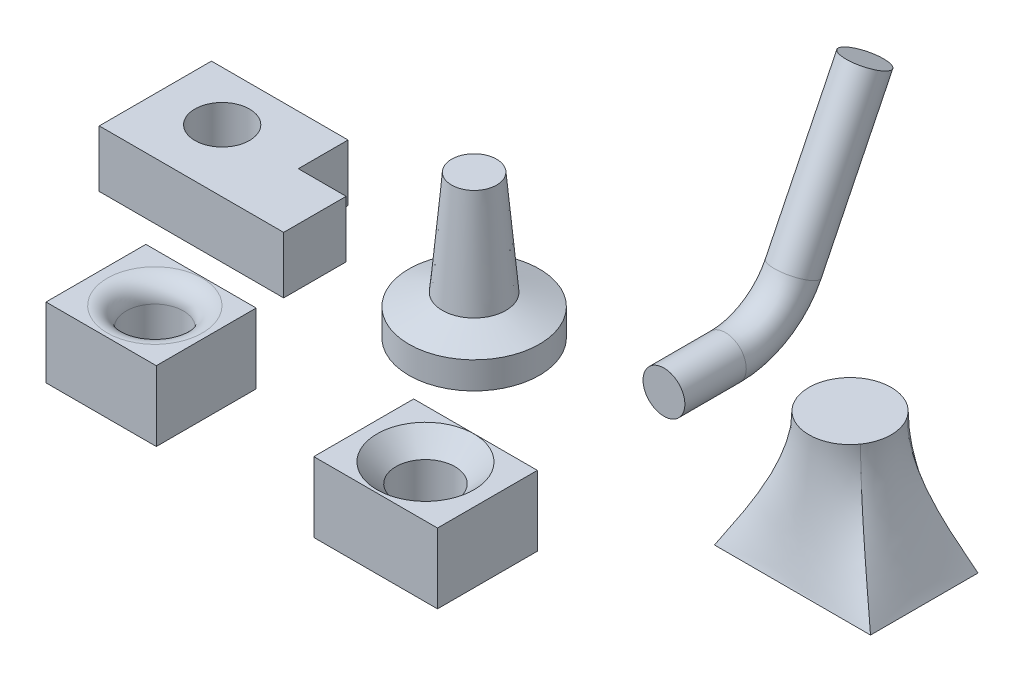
ISO-10303-21;
HEADER;
FILE_DESCRIPTION(('STEP AP214'),'2;1');
FILE_NAME('part.step','',(''),(''),'','','');
FILE_SCHEMA(('AUTOMOTIVE_DESIGN { 1 0 10303 214 1 1 1 1 }'));
ENDSEC;
DATA;
#1=APPLICATION_CONTEXT('core data for automotive mechanical design processes');
#2=APPLICATION_PROTOCOL_DEFINITION('international standard','automotive_design',2000,#1);
#3=PRODUCT_CONTEXT('',#1,'mechanical');
#4=PRODUCT('Part','Part','',(#3));
#5=PRODUCT_RELATED_PRODUCT_CATEGORY('part','',(#4));
#6=PRODUCT_DEFINITION_FORMATION('','',#4);
#7=PRODUCT_DEFINITION_CONTEXT('part definition',#1,'design');
#8=PRODUCT_DEFINITION('design','',#6,#7);
#9=PRODUCT_DEFINITION_SHAPE('','',#8);
#10=(LENGTH_UNIT() NAMED_UNIT(*) SI_UNIT(.MILLI.,.METRE.));
#11=(NAMED_UNIT(*) PLANE_ANGLE_UNIT() SI_UNIT($,.RADIAN.));
#12=(NAMED_UNIT(*) SI_UNIT($,.STERADIAN.) SOLID_ANGLE_UNIT());
#13=UNCERTAINTY_MEASURE_WITH_UNIT(LENGTH_MEASURE(1.E-05),#10,'distance_accuracy_value','');
#14=(GEOMETRIC_REPRESENTATION_CONTEXT(3) GLOBAL_UNCERTAINTY_ASSIGNED_CONTEXT((#13)) GLOBAL_UNIT_ASSIGNED_CONTEXT((#10,
#11,#12)) REPRESENTATION_CONTEXT('',''));
#15=CARTESIAN_POINT('',(0.,0.,0.));
#16=DIRECTION('',(0.,0.,1.));
#17=DIRECTION('',(1.,0.,0.));
#18=AXIS2_PLACEMENT_3D('',#15,#16,#17);
#19=CARTESIAN_POINT('',(87.1215802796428,37.,134.618684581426));
#20=DIRECTION('',(0.,1.,0.));
#21=DIRECTION('',(0.,0.,1.));
#22=AXIS2_PLACEMENT_3D('',#19,#20,#21);
#23=PLANE('',#22);
#24=CARTESIAN_POINT('',(119.007162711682,37.,107.507885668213));
#25=DIRECTION('',(0.,1.,0.));
#26=DIRECTION('',(0.,0.,1.));
#27=AXIS2_PLACEMENT_3D('',#24,#25,#26);
#28=CIRCLE('',#27,25.6087639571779);
#29=CARTESIAN_POINT('',(119.007162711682,37.,133.11664962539));
#30=VERTEX_POINT('',#29);
#31=EDGE_CURVE('E12',#30,#30,#28,.F.);
#32=ORIENTED_EDGE('',*,*,#31,.T.);
#33=EDGE_LOOP('',(#32));
#34=FACE_BOUND('',#33,.T.);
#35=DIRECTION('',(0.,0.,1.));
#36=VECTOR('',#35,1.);
#37=CARTESIAN_POINT('',(87.1215802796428,37.,81.8567381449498));
#38=LINE('',#37,#36);
#39=CARTESIAN_POINT('',(87.1215802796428,37.,81.8567381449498));
#40=VERTEX_POINT('',#39);
#41=CARTESIAN_POINT('',(87.1215802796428,37.,134.618684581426));
#42=VERTEX_POINT('',#41);
#43=EDGE_CURVE('E110',#40,#42,#38,.T.);
#44=ORIENTED_EDGE('',*,*,#43,.T.);
#45=DIRECTION('',(1.,0.,0.));
#46=VECTOR('',#45,1.);
#47=CARTESIAN_POINT('',(87.1215802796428,37.,134.618684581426));
#48=LINE('',#47,#46);
#49=CARTESIAN_POINT('',(152.467144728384,37.,134.618684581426));
#50=VERTEX_POINT('',#49);
#51=EDGE_CURVE('E95',#42,#50,#48,.T.);
#52=ORIENTED_EDGE('',*,*,#51,.T.);
#53=DIRECTION('',(0.,0.,-1.));
#54=VECTOR('',#53,1.);
#55=CARTESIAN_POINT('',(152.467144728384,37.,81.8567381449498));
#56=LINE('',#55,#54);
#57=CARTESIAN_POINT('',(152.467144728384,37.,81.8567381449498));
#58=VERTEX_POINT('',#57);
#59=EDGE_CURVE('E59',#50,#58,#56,.T.);
#60=ORIENTED_EDGE('',*,*,#59,.T.);
#61=DIRECTION('',(-1.,0.,0.));
#62=VECTOR('',#61,1.);
#63=CARTESIAN_POINT('',(87.1215802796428,37.,81.8567381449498));
#64=LINE('',#63,#62);
#65=EDGE_CURVE('E54',#58,#40,#64,.T.);
#66=ORIENTED_EDGE('',*,*,#65,.T.);
#67=EDGE_LOOP('',(#44,#52,#60,#66));
#68=FACE_BOUND('',#67,.T.);
#69=ADVANCED_FACE('F39',(#34,#68),#23,.T.);
#70=CARTESIAN_POINT('',(87.1215802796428,0.,134.618684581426));
#71=DIRECTION('',(0.,1.,0.));
#72=DIRECTION('',(0.,0.,1.));
#73=AXIS2_PLACEMENT_3D('',#70,#71,#72);
#74=PLANE('',#73);
#75=DIRECTION('',(0.,0.,1.));
#76=VECTOR('',#75,1.);
#77=CARTESIAN_POINT('',(87.1215802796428,0.,81.8567381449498));
#78=LINE('',#77,#76);
#79=CARTESIAN_POINT('',(87.1215802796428,0.,81.8567381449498));
#80=VERTEX_POINT('',#79);
#81=CARTESIAN_POINT('',(87.1215802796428,0.,134.618684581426));
#82=VERTEX_POINT('',#81);
#83=EDGE_CURVE('E86',#80,#82,#78,.T.);
#84=ORIENTED_EDGE('',*,*,#83,.F.);
#85=DIRECTION('',(-1.,0.,0.));
#86=VECTOR('',#85,1.);
#87=CARTESIAN_POINT('',(87.1215802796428,0.,81.8567381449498));
#88=LINE('',#87,#86);
#89=CARTESIAN_POINT('',(152.467144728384,0.,81.8567381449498));
#90=VERTEX_POINT('',#89);
#91=EDGE_CURVE('E108',#90,#80,#88,.T.);
#92=ORIENTED_EDGE('',*,*,#91,.F.);
#93=DIRECTION('',(0.,0.,-1.));
#94=VECTOR('',#93,1.);
#95=CARTESIAN_POINT('',(152.467144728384,0.,81.8567381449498));
#96=LINE('',#95,#94);
#97=CARTESIAN_POINT('',(152.467144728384,0.,134.618684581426));
#98=VERTEX_POINT('',#97);
#99=EDGE_CURVE('E87',#98,#90,#96,.T.);
#100=ORIENTED_EDGE('',*,*,#99,.F.);
#101=DIRECTION('',(1.,0.,0.));
#102=VECTOR('',#101,1.);
#103=CARTESIAN_POINT('',(87.1215802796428,0.,134.618684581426));
#104=LINE('',#103,#102);
#105=EDGE_CURVE('E80',#82,#98,#104,.T.);
#106=ORIENTED_EDGE('',*,*,#105,.F.);
#107=EDGE_LOOP('',(#84,#92,#100,#106));
#108=FACE_BOUND('',#107,.T.);
#109=CARTESIAN_POINT('',(119.007162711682,0.,107.507885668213));
#110=DIRECTION('',(0.,1.,0.));
#111=DIRECTION('',(0.,0.,1.));
#112=AXIS2_PLACEMENT_3D('',#109,#110,#111);
#113=CIRCLE('',#112,15.6087639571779);
#114=CARTESIAN_POINT('',(119.007162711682,0.,123.11664962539));
#115=VERTEX_POINT('',#114);
#116=EDGE_CURVE('E102',#115,#115,#113,.T.);
#117=ORIENTED_EDGE('',*,*,#116,.T.);
#118=EDGE_LOOP('',(#117));
#119=FACE_BOUND('',#118,.T.);
#120=ADVANCED_FACE('F82',(#108,#119),#74,.F.);
#121=CARTESIAN_POINT('',(87.1215802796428,37.,81.8567381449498));
#122=DIRECTION('',(1.,0.,0.));
#123=DIRECTION('',(0.,0.,-1.));
#124=AXIS2_PLACEMENT_3D('',#121,#122,#123);
#125=PLANE('',#124);
#126=ORIENTED_EDGE('',*,*,#83,.T.);
#127=DIRECTION('',(0.,-1.,0.));
#128=VECTOR('',#127,1.);
#129=CARTESIAN_POINT('',(87.1215802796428,37.,134.618684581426));
#130=LINE('',#129,#128);
#131=EDGE_CURVE('E93',#42,#82,#130,.T.);
#132=ORIENTED_EDGE('',*,*,#131,.F.);
#133=ORIENTED_EDGE('',*,*,#43,.F.);
#134=DIRECTION('',(0.,-1.,0.));
#135=VECTOR('',#134,1.);
#136=CARTESIAN_POINT('',(87.1215802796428,37.,81.8567381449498));
#137=LINE('',#136,#135);
#138=EDGE_CURVE('E101',#40,#80,#137,.T.);
#139=ORIENTED_EDGE('',*,*,#138,.T.);
#140=EDGE_LOOP('',(#126,#132,#133,#139));
#141=FACE_BOUND('',#140,.T.);
#142=ADVANCED_FACE('F41',(#141),#125,.F.);
#143=CARTESIAN_POINT('',(87.1215802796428,37.,134.618684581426));
#144=DIRECTION('',(0.,0.,-1.));
#145=DIRECTION('',(-1.,0.,0.));
#146=AXIS2_PLACEMENT_3D('',#143,#144,#145);
#147=PLANE('',#146);
#148=ORIENTED_EDGE('',*,*,#105,.T.);
#149=DIRECTION('',(0.,-1.,0.));
#150=VECTOR('',#149,1.);
#151=CARTESIAN_POINT('',(152.467144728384,37.,134.618684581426));
#152=LINE('',#151,#150);
#153=EDGE_CURVE('E98',#50,#98,#152,.T.);
#154=ORIENTED_EDGE('',*,*,#153,.F.);
#155=ORIENTED_EDGE('',*,*,#51,.F.);
#156=ORIENTED_EDGE('',*,*,#131,.T.);
#157=EDGE_LOOP('',(#148,#154,#155,#156));
#158=FACE_BOUND('',#157,.T.);
#159=ADVANCED_FACE('F94',(#158),#147,.F.);
#160=CARTESIAN_POINT('',(152.467144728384,37.,81.8567381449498));
#161=DIRECTION('',(-1.,0.,0.));
#162=DIRECTION('',(0.,0.,1.));
#163=AXIS2_PLACEMENT_3D('',#160,#161,#162);
#164=PLANE('',#163);
#165=ORIENTED_EDGE('',*,*,#99,.T.);
#166=DIRECTION('',(0.,-1.,0.));
#167=VECTOR('',#166,1.);
#168=CARTESIAN_POINT('',(152.467144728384,37.,81.8567381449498));
#169=LINE('',#168,#167);
#170=EDGE_CURVE('E116',#58,#90,#169,.T.);
#171=ORIENTED_EDGE('',*,*,#170,.F.);
#172=ORIENTED_EDGE('',*,*,#59,.F.);
#173=ORIENTED_EDGE('',*,*,#153,.T.);
#174=EDGE_LOOP('',(#165,#171,#172,#173));
#175=FACE_BOUND('',#174,.T.);
#176=ADVANCED_FACE('F145',(#175),#164,.F.);
#177=CARTESIAN_POINT('',(87.1215802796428,37.,81.8567381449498));
#178=DIRECTION('',(0.,0.,1.));
#179=DIRECTION('',(1.,0.,0.));
#180=AXIS2_PLACEMENT_3D('',#177,#178,#179);
#181=PLANE('',#180);
#182=ORIENTED_EDGE('',*,*,#91,.T.);
#183=ORIENTED_EDGE('',*,*,#138,.F.);
#184=ORIENTED_EDGE('',*,*,#65,.F.);
#185=ORIENTED_EDGE('',*,*,#170,.T.);
#186=EDGE_LOOP('',(#182,#183,#184,#185));
#187=FACE_BOUND('',#186,.T.);
#188=ADVANCED_FACE('F132',(#187),#181,.F.);
#189=CARTESIAN_POINT('',(119.007162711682,37.,107.507885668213));
#190=DIRECTION('',(0.,-1.,0.));
#191=DIRECTION('',(0.,0.,-1.));
#192=AXIS2_PLACEMENT_3D('',#189,#190,#191);
#193=CYLINDRICAL_SURFACE('',#192,15.6087639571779);
#194=CARTESIAN_POINT('',(119.007162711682,27.,107.507885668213));
#195=DIRECTION('',(0.,1.,0.));
#196=DIRECTION('',(0.,0.,1.));
#197=AXIS2_PLACEMENT_3D('',#194,#195,#196);
#198=CIRCLE('',#197,15.6087639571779);
#199=CARTESIAN_POINT('',(119.007162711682,27.,123.11664962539));
#200=VERTEX_POINT('',#199);
#201=EDGE_CURVE('E47',#200,#200,#198,.T.);
#202=ORIENTED_EDGE('',*,*,#201,.T.);
#203=EDGE_LOOP('',(#202));
#204=FACE_BOUND('',#203,.T.);
#205=ORIENTED_EDGE('',*,*,#116,.F.);
#206=EDGE_LOOP('',(#205));
#207=FACE_BOUND('',#206,.T.);
#208=ADVANCED_FACE('F122',(#204,#207),#193,.F.);
#209=CARTESIAN_POINT('',(119.007162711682,27.,107.507885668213));
#210=DIRECTION('',(0.,1.,0.));
#211=DIRECTION('',(0.,0.,1.));
#212=AXIS2_PLACEMENT_3D('',#209,#210,#211);
#213=CONICAL_SURFACE('',#212,15.6087639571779,0.78539816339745);
#214=ORIENTED_EDGE('',*,*,#31,.F.);
#215=EDGE_LOOP('',(#214));
#216=FACE_BOUND('',#215,.T.);
#217=ORIENTED_EDGE('',*,*,#201,.F.);
#218=EDGE_LOOP('',(#217));
#219=FACE_BOUND('',#218,.T.);
#220=ADVANCED_FACE('F125',(#216,#219),#213,.F.);
#221=CLOSED_SHELL('',(#69,#120,#142,#159,#176,#188,#208,#220));
#222=MANIFOLD_SOLID_BREP('B2',#221);
#223=CARTESIAN_POINT('',(-54.3365674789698,37.,134.618684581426));
#224=DIRECTION('',(0.,1.,0.));
#225=DIRECTION('',(0.,0.,1.));
#226=AXIS2_PLACEMENT_3D('',#223,#224,#225);
#227=PLANE('',#226);
#228=CARTESIAN_POINT('',(-23.958014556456,37.,107.507885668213));
#229=DIRECTION('',(0.,1.,0.));
#230=DIRECTION('',(0.,0.,1.));
#231=AXIS2_PLACEMENT_3D('',#228,#229,#230);
#232=CIRCLE('',#231,25.1013347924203);
#233=CARTESIAN_POINT('',(-23.958014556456,37.,132.609220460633));
#234=VERTEX_POINT('',#233);
#235=EDGE_CURVE('E37',#234,#234,#232,.F.);
#236=ORIENTED_EDGE('',*,*,#235,.T.);
#237=EDGE_LOOP('',(#236));
#238=FACE_BOUND('',#237,.T.);
#239=DIRECTION('',(0.,0.,1.));
#240=VECTOR('',#239,1.);
#241=CARTESIAN_POINT('',(-54.3365674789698,37.,81.8567381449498));
#242=LINE('',#241,#240);
#243=CARTESIAN_POINT('',(-54.3365674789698,37.,81.8567381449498));
#244=VERTEX_POINT('',#243);
#245=CARTESIAN_POINT('',(-54.3365674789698,37.,134.618684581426));
#246=VERTEX_POINT('',#245);
#247=EDGE_CURVE('E279',#244,#246,#242,.T.);
#248=ORIENTED_EDGE('',*,*,#247,.T.);
#249=DIRECTION('',(1.,0.,0.));
#250=VECTOR('',#249,1.);
#251=CARTESIAN_POINT('',(-54.3365674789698,37.,134.618684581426));
#252=LINE('',#251,#250);
#253=CARTESIAN_POINT('',(3.92938468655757,37.,134.618684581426));
#254=VERTEX_POINT('',#253);
#255=EDGE_CURVE('E264',#246,#254,#252,.T.);
#256=ORIENTED_EDGE('',*,*,#255,.T.);
#257=DIRECTION('',(0.,0.,-1.));
#258=VECTOR('',#257,1.);
#259=CARTESIAN_POINT('',(3.92938468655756,37.,81.8567381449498));
#260=LINE('',#259,#258);
#261=CARTESIAN_POINT('',(3.92938468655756,37.,81.8567381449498));
#262=VERTEX_POINT('',#261);
#263=EDGE_CURVE('E228',#254,#262,#260,.T.);
#264=ORIENTED_EDGE('',*,*,#263,.T.);
#265=DIRECTION('',(-1.,0.,0.));
#266=VECTOR('',#265,1.);
#267=CARTESIAN_POINT('',(-54.3365674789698,37.,81.8567381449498));
#268=LINE('',#267,#266);
#269=EDGE_CURVE('E223',#262,#244,#268,.T.);
#270=ORIENTED_EDGE('',*,*,#269,.T.);
#271=EDGE_LOOP('',(#248,#256,#264,#270));
#272=FACE_BOUND('',#271,.T.);
#273=ADVANCED_FACE('F208',(#238,#272),#227,.T.);
#274=CARTESIAN_POINT('',(-54.3365674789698,0.,134.618684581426));
#275=DIRECTION('',(0.,1.,0.));
#276=DIRECTION('',(0.,0.,1.));
#277=AXIS2_PLACEMENT_3D('',#274,#275,#276);
#278=PLANE('',#277);
#279=DIRECTION('',(0.,0.,1.));
#280=VECTOR('',#279,1.);
#281=CARTESIAN_POINT('',(-54.3365674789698,0.,81.8567381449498));
#282=LINE('',#281,#280);
#283=CARTESIAN_POINT('',(-54.3365674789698,0.,81.8567381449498));
#284=VERTEX_POINT('',#283);
#285=CARTESIAN_POINT('',(-54.3365674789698,0.,134.618684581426));
#286=VERTEX_POINT('',#285);
#287=EDGE_CURVE('E255',#284,#286,#282,.T.);
#288=ORIENTED_EDGE('',*,*,#287,.F.);
#289=DIRECTION('',(-1.,0.,0.));
#290=VECTOR('',#289,1.);
#291=CARTESIAN_POINT('',(-54.3365674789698,0.,81.8567381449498));
#292=LINE('',#291,#290);
#293=CARTESIAN_POINT('',(3.92938468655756,0.,81.8567381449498));
#294=VERTEX_POINT('',#293);
#295=EDGE_CURVE('E277',#294,#284,#292,.T.);
#296=ORIENTED_EDGE('',*,*,#295,.F.);
#297=DIRECTION('',(0.,0.,-1.));
#298=VECTOR('',#297,1.);
#299=CARTESIAN_POINT('',(3.92938468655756,0.,81.8567381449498));
#300=LINE('',#299,#298);
#301=CARTESIAN_POINT('',(3.92938468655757,0.,134.618684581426));
#302=VERTEX_POINT('',#301);
#303=EDGE_CURVE('E256',#302,#294,#300,.T.);
#304=ORIENTED_EDGE('',*,*,#303,.F.);
#305=DIRECTION('',(1.,0.,0.));
#306=VECTOR('',#305,1.);
#307=CARTESIAN_POINT('',(-54.3365674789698,0.,134.618684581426));
#308=LINE('',#307,#306);
#309=EDGE_CURVE('E249',#286,#302,#308,.T.);
#310=ORIENTED_EDGE('',*,*,#309,.F.);
#311=EDGE_LOOP('',(#288,#296,#304,#310));
#312=FACE_BOUND('',#311,.T.);
#313=CARTESIAN_POINT('',(-23.958014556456,0.,107.507885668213));
#314=DIRECTION('',(0.,1.,0.));
#315=DIRECTION('',(0.,0.,1.));
#316=AXIS2_PLACEMENT_3D('',#313,#314,#315);
#317=CIRCLE('',#316,15.1013347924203);
#318=CARTESIAN_POINT('',(-23.958014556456,0.,122.609220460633));
#319=VERTEX_POINT('',#318);
#320=EDGE_CURVE('E271',#319,#319,#317,.T.);
#321=ORIENTED_EDGE('',*,*,#320,.T.);
#322=EDGE_LOOP('',(#321));
#323=FACE_BOUND('',#322,.T.);
#324=ADVANCED_FACE('F251',(#312,#323),#278,.F.);
#325=CARTESIAN_POINT('',(-54.3365674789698,37.,81.8567381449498));
#326=DIRECTION('',(1.,0.,0.));
#327=DIRECTION('',(0.,0.,-1.));
#328=AXIS2_PLACEMENT_3D('',#325,#326,#327);
#329=PLANE('',#328);
#330=ORIENTED_EDGE('',*,*,#287,.T.);
#331=DIRECTION('',(0.,-1.,0.));
#332=VECTOR('',#331,1.);
#333=CARTESIAN_POINT('',(-54.3365674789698,37.,134.618684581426));
#334=LINE('',#333,#332);
#335=EDGE_CURVE('E262',#246,#286,#334,.T.);
#336=ORIENTED_EDGE('',*,*,#335,.F.);
#337=ORIENTED_EDGE('',*,*,#247,.F.);
#338=DIRECTION('',(0.,-1.,0.));
#339=VECTOR('',#338,1.);
#340=CARTESIAN_POINT('',(-54.3365674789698,37.,81.8567381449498));
#341=LINE('',#340,#339);
#342=EDGE_CURVE('E270',#244,#284,#341,.T.);
#343=ORIENTED_EDGE('',*,*,#342,.T.);
#344=EDGE_LOOP('',(#330,#336,#337,#343));
#345=FACE_BOUND('',#344,.T.);
#346=ADVANCED_FACE('F210',(#345),#329,.F.);
#347=CARTESIAN_POINT('',(-54.3365674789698,37.,134.618684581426));
#348=DIRECTION('',(0.,0.,-1.));
#349=DIRECTION('',(-1.,0.,0.));
#350=AXIS2_PLACEMENT_3D('',#347,#348,#349);
#351=PLANE('',#350);
#352=ORIENTED_EDGE('',*,*,#309,.T.);
#353=DIRECTION('',(0.,-1.,0.));
#354=VECTOR('',#353,1.);
#355=CARTESIAN_POINT('',(3.92938468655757,37.,134.618684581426));
#356=LINE('',#355,#354);
#357=EDGE_CURVE('E267',#254,#302,#356,.T.);
#358=ORIENTED_EDGE('',*,*,#357,.F.);
#359=ORIENTED_EDGE('',*,*,#255,.F.);
#360=ORIENTED_EDGE('',*,*,#335,.T.);
#361=EDGE_LOOP('',(#352,#358,#359,#360));
#362=FACE_BOUND('',#361,.T.);
#363=ADVANCED_FACE('F263',(#362),#351,.F.);
#364=CARTESIAN_POINT('',(3.92938468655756,37.,81.8567381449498));
#365=DIRECTION('',(-1.,0.,0.));
#366=DIRECTION('',(0.,0.,1.));
#367=AXIS2_PLACEMENT_3D('',#364,#365,#366);
#368=PLANE('',#367);
#369=ORIENTED_EDGE('',*,*,#303,.T.);
#370=DIRECTION('',(0.,-1.,0.));
#371=VECTOR('',#370,1.);
#372=CARTESIAN_POINT('',(3.92938468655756,37.,81.8567381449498));
#373=LINE('',#372,#371);
#374=EDGE_CURVE('E285',#262,#294,#373,.T.);
#375=ORIENTED_EDGE('',*,*,#374,.F.);
#376=ORIENTED_EDGE('',*,*,#263,.F.);
#377=ORIENTED_EDGE('',*,*,#357,.T.);
#378=EDGE_LOOP('',(#369,#375,#376,#377));
#379=FACE_BOUND('',#378,.T.);
#380=ADVANCED_FACE('F314',(#379),#368,.F.);
#381=CARTESIAN_POINT('',(-54.3365674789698,37.,81.8567381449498));
#382=DIRECTION('',(0.,0.,1.));
#383=DIRECTION('',(1.,0.,0.));
#384=AXIS2_PLACEMENT_3D('',#381,#382,#383);
#385=PLANE('',#384);
#386=ORIENTED_EDGE('',*,*,#295,.T.);
#387=ORIENTED_EDGE('',*,*,#342,.F.);
#388=ORIENTED_EDGE('',*,*,#269,.F.);
#389=ORIENTED_EDGE('',*,*,#374,.T.);
#390=EDGE_LOOP('',(#386,#387,#388,#389));
#391=FACE_BOUND('',#390,.T.);
#392=ADVANCED_FACE('F301',(#391),#385,.F.);
#393=CARTESIAN_POINT('',(-23.958014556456,37.,107.507885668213));
#394=DIRECTION('',(0.,-1.,0.));
#395=DIRECTION('',(0.,0.,-1.));
#396=AXIS2_PLACEMENT_3D('',#393,#394,#395);
#397=CYLINDRICAL_SURFACE('',#396,15.1013347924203);
#398=CARTESIAN_POINT('',(-23.958014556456,27.,107.507885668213));
#399=DIRECTION('',(0.,1.,0.));
#400=DIRECTION('',(0.,0.,1.));
#401=AXIS2_PLACEMENT_3D('',#398,#399,#400);
#402=CIRCLE('',#401,15.1013347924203);
#403=CARTESIAN_POINT('',(-23.958014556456,27.,122.609220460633));
#404=VERTEX_POINT('',#403);
#405=EDGE_CURVE('E216',#404,#404,#402,.T.);
#406=ORIENTED_EDGE('',*,*,#405,.T.);
#407=EDGE_LOOP('',(#406));
#408=FACE_BOUND('',#407,.T.);
#409=ORIENTED_EDGE('',*,*,#320,.F.);
#410=EDGE_LOOP('',(#409));
#411=FACE_BOUND('',#410,.T.);
#412=ADVANCED_FACE('F291',(#408,#411),#397,.F.);
#413=CARTESIAN_POINT('',(-23.958014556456,27.,107.507885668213));
#414=DIRECTION('',(0.,1.,0.));
#415=DIRECTION('',(0.,0.,1.));
#416=AXIS2_PLACEMENT_3D('',#413,#414,#415);
#417=TOROIDAL_SURFACE('',#416,25.1013347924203,10.);
#418=ORIENTED_EDGE('',*,*,#235,.F.);
#419=EDGE_LOOP('',(#418));
#420=FACE_BOUND('',#419,.T.);
#421=ORIENTED_EDGE('',*,*,#405,.F.);
#422=EDGE_LOOP('',(#421));
#423=FACE_BOUND('',#422,.T.);
#424=ADVANCED_FACE('F294',(#420,#423),#417,.T.);
#425=CLOSED_SHELL('',(#273,#324,#346,#363,#380,#392,#412,#424));
#426=MANIFOLD_SOLID_BREP('B6',#425);
#427=CARTESIAN_POINT('',(235.780984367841,64.84531586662,0.));
#428=DIRECTION('',(0.,1.,0.));
#429=DIRECTION('',(0.,0.,1.));
#430=AXIS2_PLACEMENT_3D('',#427,#428,#429);
#431=PLANE('',#430);
#432=CARTESIAN_POINT('',(235.780984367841,64.84531586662,0.));
#433=DIRECTION('',(0.,1.,0.));
#434=DIRECTION('',(0.,0.,1.));
#435=AXIS2_PLACEMENT_3D('',#432,#433,#434);
#436=CIRCLE('',#435,21.7133282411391);
#437=CARTESIAN_POINT('',(217.899327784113,64.84531586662,12.3172635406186));
#438=VERTEX_POINT('',#437);
#439=CARTESIAN_POINT('',(253.66264095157,64.84531586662,12.3172635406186));
#440=VERTEX_POINT('',#439);
#441=EDGE_CURVE('E426',#438,#440,#436,.T.);
#442=ORIENTED_EDGE('',*,*,#441,.T.);
#443=CARTESIAN_POINT('',(253.66264095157,64.84531586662,-12.3172635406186));
#444=VERTEX_POINT('',#443);
#445=EDGE_CURVE('E432',#440,#444,#436,.T.);
#446=ORIENTED_EDGE('',*,*,#445,.T.);
#447=CARTESIAN_POINT('',(217.899327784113,64.84531586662,-12.3172635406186));
#448=VERTEX_POINT('',#447);
#449=EDGE_CURVE('E435',#444,#448,#436,.T.);
#450=ORIENTED_EDGE('',*,*,#449,.T.);
#451=EDGE_CURVE('E418',#448,#438,#436,.T.);
#452=ORIENTED_EDGE('',*,*,#451,.T.);
#453=EDGE_LOOP('',(#442,#446,#450,#452));
#454=FACE_BOUND('',#453,.T.);
#455=ADVANCED_FACE('F375',(#454),#431,.T.);
#456=CARTESIAN_POINT('',(196.396434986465,0.,32.2296843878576));
#457=DIRECTION('',(0.,1.,0.));
#458=DIRECTION('',(0.,0.,1.));
#459=AXIS2_PLACEMENT_3D('',#456,#457,#458);
#460=PLANE('',#459);
#461=DIRECTION('',(0.,0.,1.));
#462=VECTOR('',#461,1.);
#463=CARTESIAN_POINT('',(196.396434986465,0.,-24.5482956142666));
#464=LINE('',#463,#462);
#465=CARTESIAN_POINT('',(196.396434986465,0.,-24.5482956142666));
#466=VERTEX_POINT('',#465);
#467=CARTESIAN_POINT('',(196.396434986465,0.,32.2296843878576));
#468=VERTEX_POINT('',#467);
#469=EDGE_CURVE('E420',#466,#468,#464,.T.);
#470=ORIENTED_EDGE('',*,*,#469,.F.);
#471=DIRECTION('',(-1.,0.,0.));
#472=VECTOR('',#471,1.);
#473=CARTESIAN_POINT('',(196.396434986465,0.,-24.5482956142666));
#474=LINE('',#473,#472);
#475=CARTESIAN_POINT('',(278.824186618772,0.,-24.5482956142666));
#476=VERTEX_POINT('',#475);
#477=EDGE_CURVE('E206',#476,#466,#474,.T.);
#478=ORIENTED_EDGE('',*,*,#477,.F.);
#479=DIRECTION('',(0.,0.,-1.));
#480=VECTOR('',#479,1.);
#481=CARTESIAN_POINT('',(278.824186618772,0.,-24.5482956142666));
#482=LINE('',#481,#480);
#483=CARTESIAN_POINT('',(278.824186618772,0.,32.2296843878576));
#484=VERTEX_POINT('',#483);
#485=EDGE_CURVE('E379',#484,#476,#482,.T.);
#486=ORIENTED_EDGE('',*,*,#485,.F.);
#487=DIRECTION('',(1.,0.,0.));
#488=VECTOR('',#487,1.);
#489=CARTESIAN_POINT('',(196.396434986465,0.,32.2296843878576));
#490=LINE('',#489,#488);
#491=EDGE_CURVE('E390',#468,#484,#490,.T.);
#492=ORIENTED_EDGE('',*,*,#491,.F.);
#493=EDGE_LOOP('',(#470,#478,#486,#492));
#494=FACE_BOUND('',#493,.T.);
#495=ADVANCED_FACE('F377',(#494),#460,.F.);
#496=CARTESIAN_POINT('',(196.396434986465,0.,32.2296843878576));
#497=CARTESIAN_POINT('',(207.147881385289,20.5626013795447,22.2734739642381));
#498=CARTESIAN_POINT('',(217.899327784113,41.1252027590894,12.3172635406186));
#499=CARTESIAN_POINT('',(217.899327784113,64.84531586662,12.3172635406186));
#500=CARTESIAN_POINT('',(223.872352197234,0.,32.2296843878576));
#501=CARTESIAN_POINT('',(225.128641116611,14.583504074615,30.05444043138));
#502=CARTESIAN_POINT('',(227.403675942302,40.993017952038,26.1152544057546));
#503=CARTESIAN_POINT('',(227.403675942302,64.84531586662,26.1152544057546));
#504=CARTESIAN_POINT('',(251.348269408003,0.,32.2296843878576));
#505=CARTESIAN_POINT('',(248.790393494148,14.5364785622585,30.05444043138));
#506=CARTESIAN_POINT('',(244.15829279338,40.8608331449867,26.1152544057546));
#507=CARTESIAN_POINT('',(244.15829279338,64.84531586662,26.1152544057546));
#508=CARTESIAN_POINT('',(278.824186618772,0.,32.2296843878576));
#509=CARTESIAN_POINT('',(266.243413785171,20.3643241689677,22.2734739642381));
#510=CARTESIAN_POINT('',(253.66264095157,40.7286483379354,12.3172635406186));
#511=CARTESIAN_POINT('',(253.66264095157,64.84531586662,12.3172635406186));
#512=(BOUNDED_SURFACE() B_SPLINE_SURFACE(3,3,((#496,#497,#498,#499),(#500,#501,#502,#503),(#504,
#505,#506,#507),(#508,#509,#510,#511)),.UNSPECIFIED.,.F.,.F.,
.F.) B_SPLINE_SURFACE_WITH_KNOTS((4,4),(4,4),(0.,1.),(0.,1.),
.UNSPECIFIED.) GEOMETRIC_REPRESENTATION_ITEM() RATIONAL_B_SPLINE_SURFACE(((1.,1.,1.,1.),(1.,1.,
0.711511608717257,0.711511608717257),(1.,1.,0.711511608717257,0.711511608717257),(1.,1.,1.,1.))) REPRESENTATION_ITEM('') SURFACE());
#513=CARTESIAN_POINT('',(278.824186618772,0.,32.2296843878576));
#514=CARTESIAN_POINT('',(266.243413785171,20.3643241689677,22.2734739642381));
#515=CARTESIAN_POINT('',(253.66264095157,40.7286483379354,12.3172635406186));
#516=CARTESIAN_POINT('',(253.66264095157,64.84531586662,12.3172635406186));
#517=B_SPLINE_CURVE_WITH_KNOTS('',3,(#513,#514,#515,#516),.UNSPECIFIED.,.F.,.F.,(4,4),(0.,1.),.UNSPECIFIED.);
#518=EDGE_CURVE('E422',#484,#440,#517,.T.);
#519=CARTESIAN_POINT('',(196.396434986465,0.,32.2296843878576));
#520=CARTESIAN_POINT('',(207.147881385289,20.5626013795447,22.2734739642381));
#521=CARTESIAN_POINT('',(217.899327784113,41.1252027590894,12.3172635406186));
#522=CARTESIAN_POINT('',(217.899327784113,64.84531586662,12.3172635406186));
#523=B_SPLINE_CURVE_WITH_KNOTS('',3,(#519,#520,#521,#522),.UNSPECIFIED.,.F.,.F.,(4,4),(0.,1.),.UNSPECIFIED.);
#524=EDGE_CURVE('E414',#438,#468,#523,.F.);
#525=ORIENTED_EDGE('',*,*,#491,.T.);
#526=ORIENTED_EDGE('',*,*,#518,.T.);
#527=ORIENTED_EDGE('',*,*,#441,.F.);
#528=ORIENTED_EDGE('',*,*,#524,.T.);
#529=EDGE_LOOP('',(#525,#526,#527,#528));
#530=FACE_BOUND('',#529,.T.);
#531=ADVANCED_FACE('F427',(#530),#512,.T.);
#532=CARTESIAN_POINT('',(278.824186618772,0.,32.2296843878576));
#533=CARTESIAN_POINT('',(266.243413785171,20.3643241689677,22.2734739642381));
#534=CARTESIAN_POINT('',(253.66264095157,40.7286483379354,12.3172635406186));
#535=CARTESIAN_POINT('',(253.66264095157,64.84531586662,12.3172635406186));
#536=CARTESIAN_POINT('',(278.824186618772,0.,13.3036910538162));
#537=CARTESIAN_POINT('',(270.052529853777,18.0532332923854,9.48727402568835));
#538=CARTESIAN_POINT('',(258.941828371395,40.9205309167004,4.65317352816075));
#539=CARTESIAN_POINT('',(258.941828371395,64.84531586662,4.65317352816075));
#540=CARTESIAN_POINT('',(278.824186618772,0.,-5.62230228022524));
#541=CARTESIAN_POINT('',(270.052529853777,18.1378876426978,-5.19474410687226));
#542=CARTESIAN_POINT('',(258.941828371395,41.1124134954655,-4.65317352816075));
#543=CARTESIAN_POINT('',(258.941828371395,64.84531586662,-4.65317352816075));
#544=CARTESIAN_POINT('',(278.824186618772,0.,-24.5482956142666));
#545=CARTESIAN_POINT('',(266.243413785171,20.6521480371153,-18.4327795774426));
#546=CARTESIAN_POINT('',(253.66264095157,41.3042960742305,-12.3172635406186));
#547=CARTESIAN_POINT('',(253.66264095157,64.84531586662,-12.3172635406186));
#548=(BOUNDED_SURFACE() B_SPLINE_SURFACE(3,3,((#532,#533,#534,#535),(#536,#537,#538,#539),(#540,
#541,#542,#543),(#544,#545,#546,#547)),.UNSPECIFIED.,.F.,.F.,
.F.) B_SPLINE_SURFACE_WITH_KNOTS((4,4),(4,4),(0.,1.),(0.,1.),
.UNSPECIFIED.) GEOMETRIC_REPRESENTATION_ITEM() RATIONAL_B_SPLINE_SURFACE(((1.,1.,1.,1.),(1.,1.,
0.882355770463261,0.882355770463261),(1.,1.,0.882355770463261,0.882355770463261),(1.,1.,1.,1.))) REPRESENTATION_ITEM('') SURFACE());
#549=CARTESIAN_POINT('',(278.824186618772,0.,-24.5482956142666));
#550=CARTESIAN_POINT('',(266.243413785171,20.6521480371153,-18.4327795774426));
#551=CARTESIAN_POINT('',(253.66264095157,41.3042960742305,-12.3172635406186));
#552=CARTESIAN_POINT('',(253.66264095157,64.84531586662,-12.3172635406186));
#553=B_SPLINE_CURVE_WITH_KNOTS('',3,(#549,#550,#551,#552),.UNSPECIFIED.,.F.,.F.,(4,4),(0.,1.),.UNSPECIFIED.);
#554=EDGE_CURVE('E423',#476,#444,#553,.T.);
#555=ORIENTED_EDGE('',*,*,#485,.T.);
#556=ORIENTED_EDGE('',*,*,#554,.T.);
#557=ORIENTED_EDGE('',*,*,#445,.F.);
#558=ORIENTED_EDGE('',*,*,#518,.F.);
#559=EDGE_LOOP('',(#555,#556,#557,#558));
#560=FACE_BOUND('',#559,.T.);
#561=ADVANCED_FACE('F464',(#560),#548,.T.);
#562=CARTESIAN_POINT('',(196.396434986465,0.,-24.5482956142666));
#563=CARTESIAN_POINT('',(207.147881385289,20.8553578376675,-18.4327795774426));
#564=CARTESIAN_POINT('',(217.899327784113,41.7107156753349,-12.3172635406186));
#565=CARTESIAN_POINT('',(217.899327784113,64.84531586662,-12.3172635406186));
#566=CARTESIAN_POINT('',(196.396434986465,0.,-5.62230228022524));
#567=CARTESIAN_POINT('',(203.553975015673,18.3157402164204,-5.19474410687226));
#568=CARTESIAN_POINT('',(212.620140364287,41.5155447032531,-4.65317352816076));
#569=CARTESIAN_POINT('',(212.620140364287,64.84531586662,-4.65317352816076));
#570=CARTESIAN_POINT('',(196.396434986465,0.,13.3036910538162));
#571=CARTESIAN_POINT('',(203.553975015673,18.2296350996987,9.48727402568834));
#572=CARTESIAN_POINT('',(212.620140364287,41.3203737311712,4.65317352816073));
#573=CARTESIAN_POINT('',(212.620140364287,64.84531586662,4.65317352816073));
#574=CARTESIAN_POINT('',(196.396434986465,0.,32.2296843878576));
#575=CARTESIAN_POINT('',(207.147881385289,20.5626013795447,22.2734739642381));
#576=CARTESIAN_POINT('',(217.899327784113,41.1252027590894,12.3172635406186));
#577=CARTESIAN_POINT('',(217.899327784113,64.84531586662,12.3172635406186));
#578=(BOUNDED_SURFACE() B_SPLINE_SURFACE(3,3,((#562,#563,#564,#565),(#566,#567,#568,#569),(#570,
#571,#572,#573),(#574,#575,#576,#577)),.UNSPECIFIED.,.F.,.F.,
.F.) B_SPLINE_SURFACE_WITH_KNOTS((4,4),(4,4),(0.,1.),(0.,1.),
.UNSPECIFIED.) GEOMETRIC_REPRESENTATION_ITEM() RATIONAL_B_SPLINE_SURFACE(((1.,1.,1.,1.),(1.,1.,
0.882355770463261,0.882355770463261),(1.,1.,0.882355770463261,0.882355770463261),(1.,1.,1.,1.))) REPRESENTATION_ITEM('') SURFACE());
#579=CARTESIAN_POINT('',(196.396434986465,0.,-24.5482956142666));
#580=CARTESIAN_POINT('',(207.147881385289,20.8553578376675,-18.4327795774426));
#581=CARTESIAN_POINT('',(217.899327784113,41.7107156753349,-12.3172635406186));
#582=CARTESIAN_POINT('',(217.899327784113,64.84531586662,-12.3172635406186));
#583=B_SPLINE_CURVE_WITH_KNOTS('',3,(#579,#580,#581,#582),.UNSPECIFIED.,.F.,.F.,(4,4),(0.,1.),.UNSPECIFIED.);
#584=EDGE_CURVE('E431',#466,#448,#583,.T.);
#585=ORIENTED_EDGE('',*,*,#469,.T.);
#586=ORIENTED_EDGE('',*,*,#524,.F.);
#587=ORIENTED_EDGE('',*,*,#451,.F.);
#588=ORIENTED_EDGE('',*,*,#584,.F.);
#589=EDGE_LOOP('',(#585,#586,#587,#588));
#590=FACE_BOUND('',#589,.T.);
#591=ADVANCED_FACE('F416',(#590),#578,.T.);
#592=CARTESIAN_POINT('',(278.824186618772,0.,-24.5482956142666));
#593=CARTESIAN_POINT('',(266.243413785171,20.6521480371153,-18.4327795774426));
#594=CARTESIAN_POINT('',(253.66264095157,41.3042960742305,-12.3172635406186));
#595=CARTESIAN_POINT('',(253.66264095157,64.84531586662,-12.3172635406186));
#596=CARTESIAN_POINT('',(251.348269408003,0.,-24.5482956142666));
#597=CARTESIAN_POINT('',(248.790393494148,14.7424384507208,-25.1057502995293));
#598=CARTESIAN_POINT('',(244.15829279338,41.4397692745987,-26.1152544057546));
#599=CARTESIAN_POINT('',(244.15829279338,64.84531586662,-26.1152544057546));
#600=CARTESIAN_POINT('',(223.872352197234,0.,-24.5482956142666));
#601=CARTESIAN_POINT('',(225.128641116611,14.7906338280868,-25.1057502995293));
#602=CARTESIAN_POINT('',(227.403675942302,41.5752424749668,-26.1152544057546));
#603=CARTESIAN_POINT('',(227.403675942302,64.84531586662,-26.1152544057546));
#604=CARTESIAN_POINT('',(196.396434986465,0.,-24.5482956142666));
#605=CARTESIAN_POINT('',(207.147881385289,20.8553578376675,-18.4327795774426));
#606=CARTESIAN_POINT('',(217.899327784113,41.7107156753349,-12.3172635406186));
#607=CARTESIAN_POINT('',(217.899327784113,64.84531586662,-12.3172635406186));
#608=(BOUNDED_SURFACE() B_SPLINE_SURFACE(3,3,((#592,#593,#594,#595),(#596,#597,#598,#599),(#600,
#601,#602,#603),(#604,#605,#606,#607)),.UNSPECIFIED.,.F.,.F.,
.F.) B_SPLINE_SURFACE_WITH_KNOTS((4,4),(4,4),(0.,1.),(0.,1.),
.UNSPECIFIED.) GEOMETRIC_REPRESENTATION_ITEM() RATIONAL_B_SPLINE_SURFACE(((1.,1.,1.,1.),(1.,1.,
0.711511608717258,0.711511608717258),(1.,1.,0.711511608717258,0.711511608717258),(1.,1.,1.,1.))) REPRESENTATION_ITEM('') SURFACE());
#609=ORIENTED_EDGE('',*,*,#477,.T.);
#610=ORIENTED_EDGE('',*,*,#584,.T.);
#611=ORIENTED_EDGE('',*,*,#449,.F.);
#612=ORIENTED_EDGE('',*,*,#554,.F.);
#613=EDGE_LOOP('',(#609,#610,#611,#612));
#614=FACE_BOUND('',#613,.T.);
#615=ADVANCED_FACE('F466',(#614),#608,.T.);
#616=CLOSED_SHELL('',(#455,#495,#531,#561,#591,#615));
#617=MANIFOLD_SOLID_BREP('B31',#616);
#618=CARTESIAN_POINT('',(137.472890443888,46.7275915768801,-68.3471620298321));
#619=DIRECTION('',(0.,0.897751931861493,-0.440501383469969));
#620=DIRECTION('',(0.,0.440501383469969,0.897751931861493));
#621=AXIS2_PLACEMENT_3D('',#618,#619,#620);
#622=CYLINDRICAL_SURFACE('',#621,11.0545755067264);
#623=CARTESIAN_POINT('',(137.472890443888,46.7275915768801,-68.3471620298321));
#624=DIRECTION('',(0.,-0.897751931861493,0.440501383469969));
#625=DIRECTION('',(1.,0.,0.));
#626=AXIS2_PLACEMENT_3D('',#623,#624,#625);
#627=CIRCLE('',#626,11.0545755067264);
#628=CARTESIAN_POINT('',(137.472890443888,41.8580357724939,-78.2714285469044));
#629=VERTEX_POINT('',#628);
#630=EDGE_CURVE('E557',#629,#629,#627,.T.);
#631=ORIENTED_EDGE('',*,*,#630,.F.);
#632=EDGE_LOOP('',(#631));
#633=FACE_BOUND('',#632,.T.);
#634=CARTESIAN_POINT('',(137.472890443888,123.708469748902,-106.119493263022));
#635=DIRECTION('',(0.,-0.897751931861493,0.440501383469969));
#636=DIRECTION('',(1.,0.,0.));
#637=AXIS2_PLACEMENT_3D('',#634,#635,#636);
#638=CIRCLE('',#637,11.0545755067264);
#639=CARTESIAN_POINT('',(148.527465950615,123.708469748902,-106.119493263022));
#640=VERTEX_POINT('',#639);
#641=EDGE_CURVE('E374',#640,#640,#638,.T.);
#642=ORIENTED_EDGE('',*,*,#641,.T.);
#643=EDGE_LOOP('',(#642));
#644=FACE_BOUND('',#643,.T.);
#645=ADVANCED_FACE('F551',(#633,#644),#622,.T.);
#646=CARTESIAN_POINT('',(137.472890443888,64.3476469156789,-32.4370847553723));
#647=DIRECTION('',(1.,0.,0.));
#648=DIRECTION('',(0.,0.,-1.));
#649=AXIS2_PLACEMENT_3D('',#646,#647,#648);
#650=TOROIDAL_SURFACE('',#649,40.,11.0545755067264);
#651=CARTESIAN_POINT('',(137.472890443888,24.3476469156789,-32.4370847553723));
#652=DIRECTION('',(0.,0.,1.));
#653=DIRECTION('',(1.,0.,0.));
#654=AXIS2_PLACEMENT_3D('',#651,#652,#653);
#655=CIRCLE('',#654,11.0545755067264);
#656=CARTESIAN_POINT('',(137.472890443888,13.2930714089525,-32.4370847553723));
#657=VERTEX_POINT('',#656);
#658=EDGE_CURVE('E561',#657,#657,#655,.T.);
#659=CARTESIAN_POINT('',(137.472890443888,64.3476469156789,-32.4370847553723));
#660=DIRECTION('',(1.,0.,0.));
#661=DIRECTION('',(0.,0.,-1.));
#662=AXIS2_PLACEMENT_3D('',#659,#660,#661);
#663=CIRCLE('',#662,51.0545755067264);
#664=EDGE_CURVE('',#657,#629,#663,.T.);
#665=ORIENTED_EDGE('',*,*,#658,.F.);
#666=ORIENTED_EDGE('',*,*,#630,.T.);
#667=ORIENTED_EDGE('',*,*,#664,.T.);
#668=ORIENTED_EDGE('',*,*,#664,.F.);
#669=EDGE_LOOP('',(#665,#667,#666,#668));
#670=FACE_BOUND('',#669,.T.);
#671=ADVANCED_FACE('F576',(#670),#650,.T.);
#672=CARTESIAN_POINT('',(137.472890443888,24.3476469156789,-32.4370847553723));
#673=DIRECTION('',(0.,0.,1.));
#674=DIRECTION('',(1.,0.,0.));
#675=AXIS2_PLACEMENT_3D('',#672,#673,#674);
#676=CYLINDRICAL_SURFACE('',#675,11.0545755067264);
#677=ORIENTED_EDGE('',*,*,#658,.T.);
#678=EDGE_LOOP('',(#677));
#679=FACE_BOUND('',#678,.T.);
#680=CARTESIAN_POINT('',(137.472890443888,24.3476469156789,0.));
#681=DIRECTION('',(0.,0.,1.));
#682=DIRECTION('',(1.,0.,0.));
#683=AXIS2_PLACEMENT_3D('',#680,#681,#682);
#684=CIRCLE('',#683,11.0545755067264);
#685=CARTESIAN_POINT('',(148.527465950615,24.3476469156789,0.));
#686=VERTEX_POINT('',#685);
#687=EDGE_CURVE('E565',#686,#686,#684,.T.);
#688=ORIENTED_EDGE('',*,*,#687,.F.);
#689=EDGE_LOOP('',(#688));
#690=FACE_BOUND('',#689,.T.);
#691=ADVANCED_FACE('F573',(#679,#690),#676,.T.);
#692=CARTESIAN_POINT('',(137.472890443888,123.708469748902,-106.119493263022));
#693=DIRECTION('',(0.,-0.897751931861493,0.440501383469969));
#694=DIRECTION('',(1.,0.,0.));
#695=AXIS2_PLACEMENT_3D('',#692,#693,#694);
#696=PLANE('',#695);
#697=ORIENTED_EDGE('',*,*,#641,.F.);
#698=EDGE_LOOP('',(#697));
#699=FACE_BOUND('',#698,.T.);
#700=ADVANCED_FACE('F575',(#699),#696,.F.);
#701=CARTESIAN_POINT('',(137.472890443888,24.3476469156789,0.));
#702=DIRECTION('',(0.,0.,1.));
#703=DIRECTION('',(1.,0.,0.));
#704=AXIS2_PLACEMENT_3D('',#701,#702,#703);
#705=PLANE('',#704);
#706=ORIENTED_EDGE('',*,*,#687,.T.);
#707=EDGE_LOOP('',(#706));
#708=FACE_BOUND('',#707,.T.);
#709=ADVANCED_FACE('F571',(#708),#705,.T.);
#710=CLOSED_SHELL('',(#645,#671,#691,#700,#709));
#711=MANIFOLD_SOLID_BREP('B200',#710);
#712=CARTESIAN_POINT('',(2.73609491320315,-0.888028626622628,0.));
#713=DIRECTION('',(0.,-1.,0.));
#714=DIRECTION('',(0.,0.,-1.));
#715=AXIS2_PLACEMENT_3D('',#712,#713,#714);
#716=PLANE('',#715);
#717=CARTESIAN_POINT('',(37.2060003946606,-0.888028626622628,0.));
#718=DIRECTION('',(0.,1.,0.));
#719=DIRECTION('',(0.,0.,1.));
#720=AXIS2_PLACEMENT_3D('',#717,#718,#719);
#721=CIRCLE('',#720,34.4699054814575);
#722=CARTESIAN_POINT('',(37.2060003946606,-0.888028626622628,34.4699054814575));
#723=VERTEX_POINT('',#722);
#724=EDGE_CURVE('E550',#723,#723,#721,.T.);
#725=ORIENTED_EDGE('',*,*,#724,.F.);
#726=EDGE_LOOP('',(#725));
#727=FACE_BOUND('',#726,.T.);
#728=ADVANCED_FACE('F630',(#727),#716,.T.);
#729=CARTESIAN_POINT('',(37.2060003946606,90.5229617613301,0.));
#730=DIRECTION('',(0.,1.,0.));
#731=DIRECTION('',(0.,0.,1.));
#732=AXIS2_PLACEMENT_3D('',#729,#730,#731);
#733=CYLINDRICAL_SURFACE('',#732,34.4699054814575);
#734=ORIENTED_EDGE('',*,*,#724,.T.);
#735=EDGE_LOOP('',(#734));
#736=FACE_BOUND('',#735,.T.);
#737=CARTESIAN_POINT('',(37.2060003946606,13.3650009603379,0.));
#738=DIRECTION('',(0.,1.,0.));
#739=DIRECTION('',(0.,0.,1.));
#740=AXIS2_PLACEMENT_3D('',#737,#738,#739);
#741=CIRCLE('',#740,34.4699054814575);
#742=CARTESIAN_POINT('',(37.2060003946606,13.3650009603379,34.4699054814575));
#743=VERTEX_POINT('',#742);
#744=EDGE_CURVE('E636',#743,#743,#741,.T.);
#745=ORIENTED_EDGE('',*,*,#744,.F.);
#746=EDGE_LOOP('',(#745));
#747=FACE_BOUND('',#746,.T.);
#748=ADVANCED_FACE('F662',(#736,#747),#733,.T.);
#749=CARTESIAN_POINT('',(37.2060003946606,19.9587285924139,0.));
#750=DIRECTION('',(0.,-1.,0.));
#751=DIRECTION('',(0.,0.,-1.));
#752=AXIS2_PLACEMENT_3D('',#749,#750,#751);
#753=CONICAL_SURFACE('',#752,16.7643871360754,1.21429750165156);
#754=ORIENTED_EDGE('',*,*,#744,.T.);
#755=EDGE_LOOP('',(#754));
#756=FACE_BOUND('',#755,.T.);
#757=CARTESIAN_POINT('',(37.2060003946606,19.9587285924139,0.));
#758=DIRECTION('',(0.,1.,0.));
#759=DIRECTION('',(0.,0.,1.));
#760=AXIS2_PLACEMENT_3D('',#757,#758,#759);
#761=CIRCLE('',#760,16.7643871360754);
#762=CARTESIAN_POINT('',(37.2060003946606,19.9587285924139,16.7643871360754));
#763=VERTEX_POINT('',#762);
#764=EDGE_CURVE('E640',#763,#763,#761,.T.);
#765=ORIENTED_EDGE('',*,*,#764,.F.);
#766=EDGE_LOOP('',(#765));
#767=FACE_BOUND('',#766,.T.);
#768=ADVANCED_FACE('F654',(#756,#767),#753,.T.);
#769=CARTESIAN_POINT('',(37.2060003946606,74.8807459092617,0.));
#770=DIRECTION('',(0.,-1.,0.));
#771=DIRECTION('',(0.,0.,-1.));
#772=AXIS2_PLACEMENT_3D('',#769,#770,#771);
#773=CONICAL_SURFACE('',#772,11.8770988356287,0.0887521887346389);
#774=ORIENTED_EDGE('',*,*,#764,.T.);
#775=EDGE_LOOP('',(#774));
#776=FACE_BOUND('',#775,.T.);
#777=CARTESIAN_POINT('',(37.2060003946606,74.8807459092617,0.));
#778=DIRECTION('',(0.,1.,0.));
#779=DIRECTION('',(0.,0.,1.));
#780=AXIS2_PLACEMENT_3D('',#777,#778,#779);
#781=CIRCLE('',#780,11.8770988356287);
#782=CARTESIAN_POINT('',(37.2060003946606,74.8807459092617,11.8770988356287));
#783=VERTEX_POINT('',#782);
#784=EDGE_CURVE('E644',#783,#783,#781,.T.);
#785=ORIENTED_EDGE('',*,*,#784,.F.);
#786=EDGE_LOOP('',(#785));
#787=FACE_BOUND('',#786,.T.);
#788=ADVANCED_FACE('F652',(#776,#787),#773,.T.);
#789=CARTESIAN_POINT('',(25.3289015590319,74.8807459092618,0.));
#790=DIRECTION('',(0.,1.,0.));
#791=DIRECTION('',(0.,0.,1.));
#792=AXIS2_PLACEMENT_3D('',#789,#790,#791);
#793=PLANE('',#792);
#794=ORIENTED_EDGE('',*,*,#784,.T.);
#795=EDGE_LOOP('',(#794));
#796=FACE_BOUND('',#795,.T.);
#797=ADVANCED_FACE('F650',(#796),#793,.T.);
#798=CLOSED_SHELL('',(#728,#748,#768,#788,#797));
#799=MANIFOLD_SOLID_BREP('B369',#798);
#800=CARTESIAN_POINT('',(-55.6738007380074,30.,3.35073800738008));
#801=DIRECTION('',(1.,0.,0.));
#802=DIRECTION('',(0.,0.,-1.));
#803=AXIS2_PLACEMENT_3D('',#800,#801,#802);
#804=PLANE('',#803);
#805=DIRECTION('',(0.,0.,1.));
#806=VECTOR('',#805,1.);
#807=CARTESIAN_POINT('',(-55.6738007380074,0.,3.35073800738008));
#808=LINE('',#807,#806);
#809=CARTESIAN_POINT('',(-55.6738007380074,0.,-26.290405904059));
#810=VERTEX_POINT('',#809);
#811=CARTESIAN_POINT('',(-55.6738007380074,0.,0.));
#812=VERTEX_POINT('',#811);
#813=EDGE_CURVE('E763',#810,#812,#808,.T.);
#814=ORIENTED_EDGE('',*,*,#813,.F.);
#815=DIRECTION('',(0.,-1.,0.));
#816=VECTOR('',#815,1.);
#817=CARTESIAN_POINT('',(-55.6738007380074,30.,-26.290405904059));
#818=LINE('',#817,#816);
#819=CARTESIAN_POINT('',(-55.6738007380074,30.,-26.290405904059));
#820=VERTEX_POINT('',#819);
#821=EDGE_CURVE('E628',#820,#810,#818,.T.);
#822=ORIENTED_EDGE('',*,*,#821,.F.);
#823=DIRECTION('',(0.,0.,1.));
#824=VECTOR('',#823,1.);
#825=CARTESIAN_POINT('',(-55.6738007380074,30.,3.35073800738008));
#826=LINE('',#825,#824);
#827=CARTESIAN_POINT('',(-55.6738007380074,30.,0.));
#828=VERTEX_POINT('',#827);
#829=EDGE_CURVE('E787',#820,#828,#826,.T.);
#830=ORIENTED_EDGE('',*,*,#829,.T.);
#831=DIRECTION('',(0.,-1.,0.));
#832=VECTOR('',#831,1.);
#833=CARTESIAN_POINT('',(-55.6738007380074,30.,0.));
#834=LINE('',#833,#832);
#835=EDGE_CURVE('E715',#828,#812,#834,.T.);
#836=ORIENTED_EDGE('',*,*,#835,.T.);
#837=EDGE_LOOP('',(#814,#822,#830,#836));
#838=FACE_BOUND('',#837,.T.);
#839=ADVANCED_FACE('F700',(#838),#804,.T.);
#840=CARTESIAN_POINT('',(-167.978514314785,30.,-26.290405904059));
#841=DIRECTION('',(0.,0.,-1.));
#842=DIRECTION('',(-1.,0.,0.));
#843=AXIS2_PLACEMENT_3D('',#840,#841,#842);
#844=PLANE('',#843);
#845=DIRECTION('',(1.,0.,0.));
#846=VECTOR('',#845,1.);
#847=CARTESIAN_POINT('',(-167.978514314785,0.,-26.290405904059));
#848=LINE('',#847,#846);
#849=CARTESIAN_POINT('',(-127.843542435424,0.,-26.290405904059));
#850=VERTEX_POINT('',#849);
#851=EDGE_CURVE('E757',#850,#810,#848,.T.);
#852=ORIENTED_EDGE('',*,*,#851,.F.);
#853=DIRECTION('',(0.,-1.,0.));
#854=VECTOR('',#853,1.);
#855=CARTESIAN_POINT('',(-127.843542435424,30.,-26.290405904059));
#856=LINE('',#855,#854);
#857=CARTESIAN_POINT('',(-127.843542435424,30.,-26.290405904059));
#858=VERTEX_POINT('',#857);
#859=EDGE_CURVE('E708',#858,#850,#856,.T.);
#860=ORIENTED_EDGE('',*,*,#859,.F.);
#861=DIRECTION('',(1.,0.,0.));
#862=VECTOR('',#861,1.);
#863=CARTESIAN_POINT('',(-167.978514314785,30.,-26.290405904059));
#864=LINE('',#863,#862);
#865=EDGE_CURVE('E759',#858,#820,#864,.T.);
#866=ORIENTED_EDGE('',*,*,#865,.T.);
#867=ORIENTED_EDGE('',*,*,#821,.T.);
#868=EDGE_LOOP('',(#852,#860,#866,#867));
#869=FACE_BOUND('',#868,.T.);
#870=ADVANCED_FACE('F755',(#869),#844,.T.);
#871=CARTESIAN_POINT('',(-127.843542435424,30.,3.35073800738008));
#872=DIRECTION('',(1.,0.,0.));
#873=DIRECTION('',(0.,0.,-1.));
#874=AXIS2_PLACEMENT_3D('',#871,#872,#873);
#875=PLANE('',#874);
#876=DIRECTION('',(0.,0.,1.));
#877=VECTOR('',#876,1.);
#878=CARTESIAN_POINT('',(-127.843542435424,0.,3.35073800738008));
#879=LINE('',#878,#877);
#880=CARTESIAN_POINT('',(-127.843542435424,0.,32.9918819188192));
#881=VERTEX_POINT('',#880);
#882=EDGE_CURVE('E771',#850,#881,#879,.T.);
#883=ORIENTED_EDGE('',*,*,#882,.T.);
#884=DIRECTION('',(0.,-1.,0.));
#885=VECTOR('',#884,1.);
#886=CARTESIAN_POINT('',(-127.843542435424,30.,32.9918819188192));
#887=LINE('',#886,#885);
#888=CARTESIAN_POINT('',(-127.843542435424,30.,32.9918819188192));
#889=VERTEX_POINT('',#888);
#890=EDGE_CURVE('E804',#889,#881,#887,.T.);
#891=ORIENTED_EDGE('',*,*,#890,.F.);
#892=DIRECTION('',(0.,0.,1.));
#893=VECTOR('',#892,1.);
#894=CARTESIAN_POINT('',(-127.843542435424,30.,3.35073800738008));
#895=LINE('',#894,#893);
#896=EDGE_CURVE('E790',#858,#889,#895,.T.);
#897=ORIENTED_EDGE('',*,*,#896,.F.);
#898=ORIENTED_EDGE('',*,*,#859,.T.);
#899=EDGE_LOOP('',(#883,#891,#897,#898));
#900=FACE_BOUND('',#899,.T.);
#901=ADVANCED_FACE('F808',(#900),#875,.F.);
#902=CARTESIAN_POINT('',(-167.978514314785,30.,32.9918819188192));
#903=DIRECTION('',(0.,0.,-1.));
#904=DIRECTION('',(-1.,0.,0.));
#905=AXIS2_PLACEMENT_3D('',#902,#903,#904);
#906=PLANE('',#905);
#907=DIRECTION('',(1.,0.,0.));
#908=VECTOR('',#907,1.);
#909=CARTESIAN_POINT('',(-167.978514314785,0.,32.9918819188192));
#910=LINE('',#909,#908);
#911=CARTESIAN_POINT('',(-30.4143911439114,0.,32.9918819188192));
#912=VERTEX_POINT('',#911);
#913=EDGE_CURVE('E773',#881,#912,#910,.T.);
#914=ORIENTED_EDGE('',*,*,#913,.T.);
#915=DIRECTION('',(0.,-1.,0.));
#916=VECTOR('',#915,1.);
#917=CARTESIAN_POINT('',(-30.4143911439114,30.,32.9918819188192));
#918=LINE('',#917,#916);
#919=CARTESIAN_POINT('',(-30.4143911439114,30.,32.9918819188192));
#920=VERTEX_POINT('',#919);
#921=EDGE_CURVE('E801',#920,#912,#918,.T.);
#922=ORIENTED_EDGE('',*,*,#921,.F.);
#923=DIRECTION('',(1.,0.,0.));
#924=VECTOR('',#923,1.);
#925=CARTESIAN_POINT('',(-167.978514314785,30.,32.9918819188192));
#926=LINE('',#925,#924);
#927=EDGE_CURVE('E793',#889,#920,#926,.T.);
#928=ORIENTED_EDGE('',*,*,#927,.F.);
#929=ORIENTED_EDGE('',*,*,#890,.T.);
#930=EDGE_LOOP('',(#914,#922,#928,#929));
#931=FACE_BOUND('',#930,.T.);
#932=ADVANCED_FACE('F816',(#931),#906,.F.);
#933=CARTESIAN_POINT('',(-30.4143911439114,30.,3.35073800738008));
#934=DIRECTION('',(-1.,0.,0.));
#935=DIRECTION('',(0.,0.,1.));
#936=AXIS2_PLACEMENT_3D('',#933,#934,#935);
#937=PLANE('',#936);
#938=DIRECTION('',(0.,0.,-1.));
#939=VECTOR('',#938,1.);
#940=CARTESIAN_POINT('',(-30.4143911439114,0.,3.35073800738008));
#941=LINE('',#940,#939);
#942=CARTESIAN_POINT('',(-30.4143911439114,0.,0.));
#943=VERTEX_POINT('',#942);
#944=EDGE_CURVE('E779',#912,#943,#941,.T.);
#945=ORIENTED_EDGE('',*,*,#944,.T.);
#946=DIRECTION('',(0.,-1.,0.));
#947=VECTOR('',#946,1.);
#948=CARTESIAN_POINT('',(-30.4143911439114,30.,0.));
#949=LINE('',#948,#947);
#950=CARTESIAN_POINT('',(-30.4143911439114,30.,0.));
#951=VERTEX_POINT('',#950);
#952=EDGE_CURVE('E799',#951,#943,#949,.T.);
#953=ORIENTED_EDGE('',*,*,#952,.F.);
#954=DIRECTION('',(0.,0.,-1.));
#955=VECTOR('',#954,1.);
#956=CARTESIAN_POINT('',(-30.4143911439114,30.,3.35073800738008));
#957=LINE('',#956,#955);
#958=EDGE_CURVE('E723',#920,#951,#957,.T.);
#959=ORIENTED_EDGE('',*,*,#958,.F.);
#960=ORIENTED_EDGE('',*,*,#921,.T.);
#961=EDGE_LOOP('',(#945,#953,#959,#960));
#962=FACE_BOUND('',#961,.T.);
#963=ADVANCED_FACE('F813',(#962),#937,.F.);
#964=CARTESIAN_POINT('',(-95.8826568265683,30.,0.));
#965=DIRECTION('',(0.,-1.,0.));
#966=DIRECTION('',(0.,0.,-1.));
#967=AXIS2_PLACEMENT_3D('',#964,#965,#966);
#968=CYLINDRICAL_SURFACE('',#967,14.4339483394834);
#969=CARTESIAN_POINT('',(-95.8826568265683,30.,0.));
#970=DIRECTION('',(0.,1.,0.));
#971=DIRECTION('',(0.,0.,1.));
#972=AXIS2_PLACEMENT_3D('',#969,#970,#971);
#973=CIRCLE('',#972,14.4339483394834);
#974=CARTESIAN_POINT('',(-95.8826568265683,30.,14.4339483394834));
#975=VERTEX_POINT('',#974);
#976=EDGE_CURVE('E784',#975,#975,#973,.T.);
#977=ORIENTED_EDGE('',*,*,#976,.T.);
#978=EDGE_LOOP('',(#977));
#979=FACE_BOUND('',#978,.T.);
#980=CARTESIAN_POINT('',(-95.8826568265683,0.,0.));
#981=DIRECTION('',(0.,1.,0.));
#982=DIRECTION('',(0.,0.,1.));
#983=AXIS2_PLACEMENT_3D('',#980,#981,#982);
#984=CIRCLE('',#983,14.4339483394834);
#985=CARTESIAN_POINT('',(-95.8826568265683,0.,14.4339483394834));
#986=VERTEX_POINT('',#985);
#987=EDGE_CURVE('E766',#986,#986,#984,.T.);
#988=ORIENTED_EDGE('',*,*,#987,.F.);
#989=EDGE_LOOP('',(#988));
#990=FACE_BOUND('',#989,.T.);
#991=ADVANCED_FACE('F702',(#979,#990),#968,.F.);
#992=CARTESIAN_POINT('',(-167.978514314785,30.,0.));
#993=DIRECTION('',(0.,0.,-1.));
#994=DIRECTION('',(-1.,0.,0.));
#995=AXIS2_PLACEMENT_3D('',#992,#993,#994);
#996=PLANE('',#995);
#997=DIRECTION('',(1.,0.,0.));
#998=VECTOR('',#997,1.);
#999=CARTESIAN_POINT('',(-167.978514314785,0.,0.));
#1000=LINE('',#999,#998);
#1001=EDGE_CURVE('E782',#812,#943,#1000,.T.);
#1002=ORIENTED_EDGE('',*,*,#1001,.F.);
#1003=ORIENTED_EDGE('',*,*,#835,.F.);
#1004=DIRECTION('',(1.,0.,0.));
#1005=VECTOR('',#1004,1.);
#1006=CARTESIAN_POINT('',(-167.978514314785,30.,0.));
#1007=LINE('',#1006,#1005);
#1008=EDGE_CURVE('E796',#828,#951,#1007,.T.);
#1009=ORIENTED_EDGE('',*,*,#1008,.T.);
#1010=ORIENTED_EDGE('',*,*,#952,.T.);
#1011=EDGE_LOOP('',(#1002,#1003,#1009,#1010));
#1012=FACE_BOUND('',#1011,.T.);
#1013=ADVANCED_FACE('F811',(#1012),#996,.T.);
#1014=CARTESIAN_POINT('',(-167.978514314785,30.,3.35073800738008));
#1015=DIRECTION('',(0.,1.,0.));
#1016=DIRECTION('',(0.,0.,1.));
#1017=AXIS2_PLACEMENT_3D('',#1014,#1015,#1016);
#1018=PLANE('',#1017);
#1019=ORIENTED_EDGE('',*,*,#976,.F.);
#1020=EDGE_LOOP('',(#1019));
#1021=FACE_BOUND('',#1020,.T.);
#1022=ORIENTED_EDGE('',*,*,#829,.F.);
#1023=ORIENTED_EDGE('',*,*,#865,.F.);
#1024=ORIENTED_EDGE('',*,*,#896,.T.);
#1025=ORIENTED_EDGE('',*,*,#927,.T.);
#1026=ORIENTED_EDGE('',*,*,#958,.T.);
#1027=ORIENTED_EDGE('',*,*,#1008,.F.);
#1028=EDGE_LOOP('',(#1022,#1023,#1024,#1025,#1026,#1027));
#1029=FACE_BOUND('',#1028,.T.);
#1030=ADVANCED_FACE('F810',(#1021,#1029),#1018,.T.);
#1031=CARTESIAN_POINT('',(-167.978514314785,0.,3.35073800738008));
#1032=DIRECTION('',(0.,1.,0.));
#1033=DIRECTION('',(0.,0.,1.));
#1034=AXIS2_PLACEMENT_3D('',#1031,#1032,#1033);
#1035=PLANE('',#1034);
#1036=ORIENTED_EDGE('',*,*,#987,.T.);
#1037=EDGE_LOOP('',(#1036));
#1038=FACE_BOUND('',#1037,.T.);
#1039=ORIENTED_EDGE('',*,*,#813,.T.);
#1040=ORIENTED_EDGE('',*,*,#1001,.T.);
#1041=ORIENTED_EDGE('',*,*,#944,.F.);
#1042=ORIENTED_EDGE('',*,*,#913,.F.);
#1043=ORIENTED_EDGE('',*,*,#882,.F.);
#1044=ORIENTED_EDGE('',*,*,#851,.T.);
#1045=EDGE_LOOP('',(#1039,#1040,#1041,#1042,#1043,#1044));
#1046=FACE_BOUND('',#1045,.T.);
#1047=ADVANCED_FACE('F769',(#1038,#1046),#1035,.F.);
#1048=CLOSED_SHELL('',(#839,#870,#901,#932,#963,#991,#1013,#1030,#1047));
#1049=MANIFOLD_SOLID_BREP('B545',#1048);
#1050=ADVANCED_BREP_SHAPE_REPRESENTATION('',(#18,#222,#426,#617,#711,#799,#1049),#14);
#1051=SHAPE_DEFINITION_REPRESENTATION(#9,#1050);
ENDSEC;
END-ISO-10303-21;
